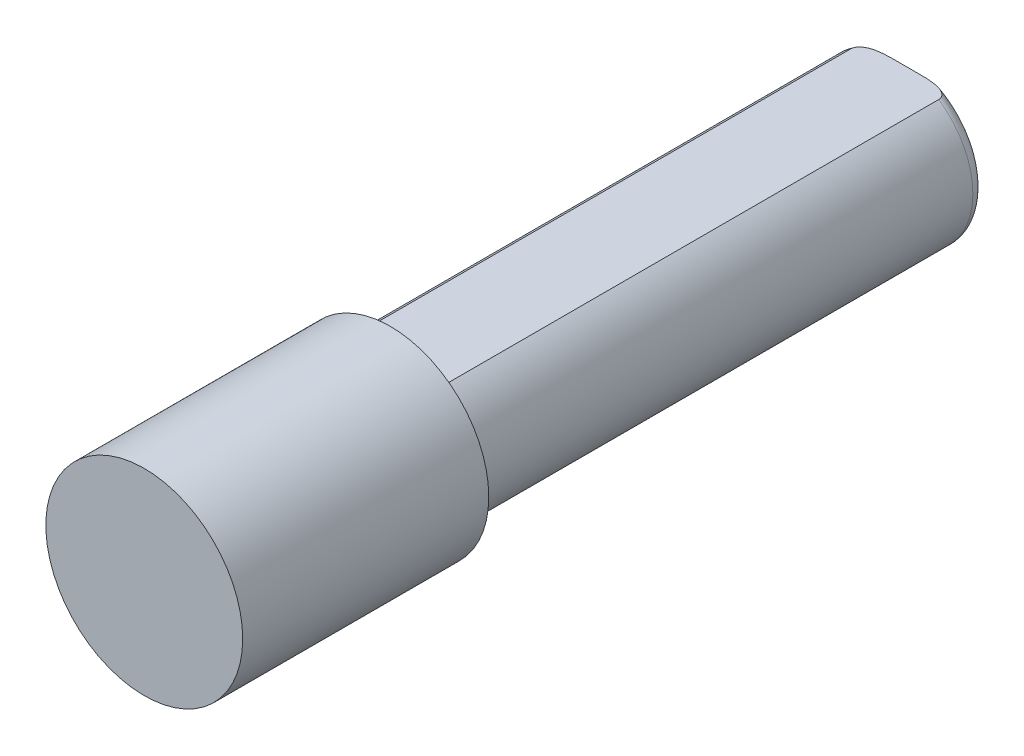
ISO-10303-21;
HEADER;
FILE_DESCRIPTION(('STEP AP214'),'2;1');
FILE_NAME('part.step','',(''),(''),'','','');
FILE_SCHEMA(('AUTOMOTIVE_DESIGN { 1 0 10303 214 1 1 1 1 }'));
ENDSEC;
DATA;
#1=APPLICATION_CONTEXT('core data for automotive mechanical design processes');
#2=APPLICATION_PROTOCOL_DEFINITION('international standard','automotive_design',2000,#1);
#3=PRODUCT_CONTEXT('',#1,'mechanical');
#4=PRODUCT('Part','Part','',(#3));
#5=PRODUCT_RELATED_PRODUCT_CATEGORY('part','',(#4));
#6=PRODUCT_DEFINITION_FORMATION('','',#4);
#7=PRODUCT_DEFINITION_CONTEXT('part definition',#1,'design');
#8=PRODUCT_DEFINITION('design','',#6,#7);
#9=PRODUCT_DEFINITION_SHAPE('','',#8);
#10=(LENGTH_UNIT() NAMED_UNIT(*) SI_UNIT(.MILLI.,.METRE.));
#11=(NAMED_UNIT(*) PLANE_ANGLE_UNIT() SI_UNIT($,.RADIAN.));
#12=(NAMED_UNIT(*) SI_UNIT($,.STERADIAN.) SOLID_ANGLE_UNIT());
#13=UNCERTAINTY_MEASURE_WITH_UNIT(LENGTH_MEASURE(1.E-05),#10,'distance_accuracy_value','');
#14=(GEOMETRIC_REPRESENTATION_CONTEXT(3) GLOBAL_UNCERTAINTY_ASSIGNED_CONTEXT((#13)) GLOBAL_UNIT_ASSIGNED_CONTEXT((#10,
#11,#12)) REPRESENTATION_CONTEXT('',''));
#15=CARTESIAN_POINT('',(0.,0.,0.));
#16=DIRECTION('',(0.,0.,1.));
#17=DIRECTION('',(1.,0.,0.));
#18=AXIS2_PLACEMENT_3D('',#15,#16,#17);
#19=CARTESIAN_POINT('',(0.,0.,21.));
#20=DIRECTION('',(0.,0.,-1.));
#21=DIRECTION('',(-1.,0.,0.));
#22=AXIS2_PLACEMENT_3D('',#19,#20,#21);
#23=CYLINDRICAL_SURFACE('',#22,3.175);
#24=DIRECTION('',(0.,0.,-1.));
#25=VECTOR('',#24,1.);
#26=CARTESIAN_POINT('',(-1.78605710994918,2.625,21.));
#27=LINE('',#26,#25);
#28=CARTESIAN_POINT('',(-1.78605710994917,2.625,21.));
#29=VERTEX_POINT('',#28);
#30=CARTESIAN_POINT('',(-1.78605710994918,2.625,0.500000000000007));
#31=VERTEX_POINT('',#30);
#32=EDGE_CURVE('E69',#29,#31,#27,.T.);
#33=ORIENTED_EDGE('',*,*,#32,.T.);
#34=CARTESIAN_POINT('',(0.,0.,0.5));
#35=DIRECTION('',(0.,0.,1.));
#36=DIRECTION('',(1.,0.,0.));
#37=AXIS2_PLACEMENT_3D('',#34,#35,#36);
#38=CIRCLE('',#37,3.175);
#39=CARTESIAN_POINT('',(1.78605710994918,2.625,0.500000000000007));
#40=VERTEX_POINT('',#39);
#41=EDGE_CURVE('E79',#31,#40,#38,.T.);
#42=ORIENTED_EDGE('',*,*,#41,.T.);
#43=DIRECTION('',(0.,0.,-1.));
#44=VECTOR('',#43,1.);
#45=CARTESIAN_POINT('',(1.78605710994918,2.625,21.));
#46=LINE('',#45,#44);
#47=CARTESIAN_POINT('',(1.78605710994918,2.625,21.));
#48=VERTEX_POINT('',#47);
#49=EDGE_CURVE('E67',#48,#40,#46,.T.);
#50=ORIENTED_EDGE('',*,*,#49,.F.);
#51=CARTESIAN_POINT('',(0.,0.,21.));
#52=DIRECTION('',(0.,0.,1.));
#53=DIRECTION('',(1.,0.,0.));
#54=AXIS2_PLACEMENT_3D('',#51,#52,#53);
#55=CIRCLE('',#54,3.175);
#56=EDGE_CURVE('E77',#29,#48,#55,.T.);
#57=ORIENTED_EDGE('',*,*,#56,.F.);
#58=EDGE_LOOP('',(#33,#42,#50,#57));
#59=FACE_BOUND('',#58,.T.);
#60=ADVANCED_FACE('F33',(#59),#23,.T.);
#61=CARTESIAN_POINT('',(0.,0.,0.));
#62=DIRECTION('',(0.,0.,1.));
#63=DIRECTION('',(1.,0.,0.));
#64=AXIS2_PLACEMENT_3D('',#61,#62,#63);
#65=PLANE('',#64);
#66=DIRECTION('',(-1.,0.,0.));
#67=VECTOR('',#66,1.);
#68=CARTESIAN_POINT('',(1.78605710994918,2.625,0.));
#69=LINE('',#68,#67);
#70=CARTESIAN_POINT('',(0.514781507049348,2.625,0.));
#71=VERTEX_POINT('',#70);
#72=CARTESIAN_POINT('',(-0.514781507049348,2.625,0.));
#73=VERTEX_POINT('',#72);
#74=EDGE_CURVE('E73',#71,#73,#69,.T.);
#75=ORIENTED_EDGE('',*,*,#74,.F.);
#76=CARTESIAN_POINT('',(0.,0.,0.));
#77=DIRECTION('',(0.,0.,1.));
#78=DIRECTION('',(1.,0.,0.));
#79=AXIS2_PLACEMENT_3D('',#76,#77,#78);
#80=CIRCLE('',#79,2.675);
#81=EDGE_CURVE('E11',#71,#73,#80,.F.);
#82=ORIENTED_EDGE('',*,*,#81,.T.);
#83=EDGE_LOOP('',(#75,#82));
#84=FACE_BOUND('',#83,.T.);
#85=ADVANCED_FACE('F109',(#84),#65,.F.);
#86=CARTESIAN_POINT('',(0.,0.,21.));
#87=DIRECTION('',(0.,0.,1.));
#88=DIRECTION('',(1.,0.,0.));
#89=AXIS2_PLACEMENT_3D('',#86,#87,#88);
#90=PLANE('',#89);
#91=CARTESIAN_POINT('',(0.,0.,21.));
#92=DIRECTION('',(0.,0.,1.));
#93=DIRECTION('',(1.,0.,0.));
#94=AXIS2_PLACEMENT_3D('',#91,#92,#93);
#95=CIRCLE('',#94,4.);
#96=CARTESIAN_POINT('',(4.,0.,21.));
#97=VERTEX_POINT('',#96);
#98=EDGE_CURVE('E87',#97,#97,#95,.T.);
#99=ORIENTED_EDGE('',*,*,#98,.F.);
#100=EDGE_LOOP('',(#99));
#101=FACE_BOUND('',#100,.T.);
#102=ORIENTED_EDGE('',*,*,#56,.T.);
#103=DIRECTION('',(-1.,0.,0.));
#104=VECTOR('',#103,1.);
#105=CARTESIAN_POINT('',(1.78605710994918,2.625,21.));
#106=LINE('',#105,#104);
#107=EDGE_CURVE('E64',#48,#29,#106,.T.);
#108=ORIENTED_EDGE('',*,*,#107,.T.);
#109=EDGE_LOOP('',(#102,#108));
#110=FACE_BOUND('',#109,.T.);
#111=ADVANCED_FACE('F81',(#101,#110),#90,.F.);
#112=CARTESIAN_POINT('',(0.,0.,31.));
#113=DIRECTION('',(0.,0.,-1.));
#114=DIRECTION('',(-1.,0.,0.));
#115=AXIS2_PLACEMENT_3D('',#112,#113,#114);
#116=CYLINDRICAL_SURFACE('',#115,4.);
#117=CARTESIAN_POINT('',(0.,0.,31.));
#118=DIRECTION('',(0.,0.,1.));
#119=DIRECTION('',(1.,0.,0.));
#120=AXIS2_PLACEMENT_3D('',#117,#118,#119);
#121=CIRCLE('',#120,4.);
#122=CARTESIAN_POINT('',(4.,0.,31.));
#123=VERTEX_POINT('',#122);
#124=EDGE_CURVE('E82',#123,#123,#121,.T.);
#125=ORIENTED_EDGE('',*,*,#124,.F.);
#126=EDGE_LOOP('',(#125));
#127=FACE_BOUND('',#126,.T.);
#128=ORIENTED_EDGE('',*,*,#98,.T.);
#129=EDGE_LOOP('',(#128));
#130=FACE_BOUND('',#129,.T.);
#131=ADVANCED_FACE('F105',(#127,#130),#116,.T.);
#132=CARTESIAN_POINT('',(0.,0.,31.));
#133=DIRECTION('',(0.,0.,1.));
#134=DIRECTION('',(1.,0.,0.));
#135=AXIS2_PLACEMENT_3D('',#132,#133,#134);
#136=PLANE('',#135);
#137=ORIENTED_EDGE('',*,*,#124,.T.);
#138=EDGE_LOOP('',(#137));
#139=FACE_BOUND('',#138,.T.);
#140=ADVANCED_FACE('F101',(#139),#136,.T.);
#141=CARTESIAN_POINT('',(1.78605710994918,2.625,21.));
#142=DIRECTION('',(0.,-1.,0.));
#143=DIRECTION('',(0.,0.,-1.));
#144=AXIS2_PLACEMENT_3D('',#141,#142,#143);
#145=PLANE('',#144);
#146=ORIENTED_EDGE('',*,*,#49,.T.);
#147=CARTESIAN_POINT('',(1.78605710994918,2.625,0.499999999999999));
#148=CARTESIAN_POINT('',(1.78611836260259,2.625,0.48051502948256));
#149=CARTESIAN_POINT('',(1.78403706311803,2.625,0.461106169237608));
#150=CARTESIAN_POINT('',(1.77614566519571,2.625,0.42329182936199));
#151=CARTESIAN_POINT('',(1.77038040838,2.625,0.404877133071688));
#152=CARTESIAN_POINT('',(1.75568721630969,2.625,0.369486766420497));
#153=CARTESIAN_POINT('',(1.74677356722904,2.625,0.352505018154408));
#154=CARTESIAN_POINT('',(1.72641804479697,2.625,0.320088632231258));
#155=CARTESIAN_POINT('',(1.71496821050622,2.625,0.304659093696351));
#156=CARTESIAN_POINT('',(1.6838317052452,2.625,0.268033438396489));
#157=CARTESIAN_POINT('',(1.66291485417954,2.625,0.247887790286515));
#158=CARTESIAN_POINT('',(1.61825721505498,2.625,0.211090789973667));
#159=CARTESIAN_POINT('',(1.59451232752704,2.625,0.194444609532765));
#160=CARTESIAN_POINT('',(1.52776741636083,2.625,0.153457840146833));
#161=CARTESIAN_POINT('',(1.48301267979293,2.625,0.131986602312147));
#162=CARTESIAN_POINT('',(1.413898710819,2.625,0.104695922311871));
#163=CARTESIAN_POINT('',(1.39041958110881,2.625,0.0963921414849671));
#164=CARTESIAN_POINT('',(1.34299986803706,2.625,0.0812423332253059));
#165=CARTESIAN_POINT('',(1.31905952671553,2.625,0.0743955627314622));
#166=CARTESIAN_POINT('',(1.23008070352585,2.625,0.0514093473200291));
#167=CARTESIAN_POINT('',(1.16404779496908,2.625,0.0391500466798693));
#168=CARTESIAN_POINT('',(1.03103589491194,2.625,0.0205768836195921));
#169=CARTESIAN_POINT('',(0.964054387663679,2.625,0.0142841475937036));
#170=CARTESIAN_POINT('',(0.833124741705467,2.625,0.00573297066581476));
#171=CARTESIAN_POINT('',(0.769187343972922,2.625,0.00329337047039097));
#172=CARTESIAN_POINT('',(0.673494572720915,2.625,0.00114815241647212));
#173=CARTESIAN_POINT('',(0.641749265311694,2.625,0.000684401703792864));
#174=CARTESIAN_POINT('',(0.578263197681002,2.625,0.000111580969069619));
#175=CARTESIAN_POINT('',(0.546522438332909,2.625,2.42149440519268E-06));
#176=CARTESIAN_POINT('',(0.514781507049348,2.625,0.));
#177=B_SPLINE_CURVE_WITH_KNOTS('',3,(#147,#148,#149,#150,#151,#152,#153,#154,#155,#156,#157,
#158,#159,#160,#161,#162,#163,#164,#165,#166,#167,#168,#169,#170,#171,#172,#173,#174,#175,#176),
.UNSPECIFIED.,.F.,.F.,(4,2,2,2,2,2,2,2,2,2,2,2,2,2,4),(0.,0.0582234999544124,0.115751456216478,
0.173021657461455,0.230474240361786,0.317101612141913,0.403856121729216,0.551884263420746,
0.626577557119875,0.701232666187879,0.902214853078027,1.10390604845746,1.29579765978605,
1.39104324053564,1.48626479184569),.UNSPECIFIED.);
#178=EDGE_CURVE('E42',#40,#71,#177,.T.);
#179=ORIENTED_EDGE('',*,*,#178,.T.);
#180=ORIENTED_EDGE('',*,*,#74,.T.);
#181=CARTESIAN_POINT('',(-0.514781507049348,2.625,0.));
#182=CARTESIAN_POINT('',(-0.545138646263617,2.625,1.99675866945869E-06));
#183=CARTESIAN_POINT('',(-0.575495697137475,2.625,0.000102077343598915));
#184=CARTESIAN_POINT('',(-0.636213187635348,2.625,0.000620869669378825));
#185=CARTESIAN_POINT('',(-0.666573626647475,2.625,0.00103964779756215));
#186=CARTESIAN_POINT('',(-0.757972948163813,2.625,0.00296465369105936));
#187=CARTESIAN_POINT('',(-0.819003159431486,2.625,0.00514219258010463));
#188=CARTESIAN_POINT('',(-0.941825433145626,2.625,0.0125778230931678));
#189=CARTESIAN_POINT('',(-1.00361494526,2.625,0.0178823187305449));
#190=CARTESIAN_POINT('',(-1.12651560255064,2.625,0.0332527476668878));
#191=CARTESIAN_POINT('',(-1.18762806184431,2.625,0.0433066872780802));
#192=CARTESIAN_POINT('',(-1.2824385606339,2.625,0.0645844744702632));
#193=CARTESIAN_POINT('',(-1.31665689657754,2.625,0.0734587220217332));
#194=CARTESIAN_POINT('',(-1.38423460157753,2.625,0.094030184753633));
#195=CARTESIAN_POINT('',(-1.41759448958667,2.625,0.105725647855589));
#196=CARTESIAN_POINT('',(-1.48318231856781,2.625,0.132705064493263));
#197=CARTESIAN_POINT('',(-1.51539860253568,2.625,0.148017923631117));
#198=CARTESIAN_POINT('',(-1.57740901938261,2.625,0.182992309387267));
#199=CARTESIAN_POINT('',(-1.60720754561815,2.625,0.202645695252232));
#200=CARTESIAN_POINT('',(-1.65201841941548,2.625,0.238603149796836));
#201=CARTESIAN_POINT('',(-1.66831627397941,2.625,0.253297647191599));
#202=CARTESIAN_POINT('',(-1.69872512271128,2.625,0.284824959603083));
#203=CARTESIAN_POINT('',(-1.71283757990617,2.625,0.301656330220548));
#204=CARTESIAN_POINT('',(-1.73617877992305,2.625,0.334788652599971));
#205=CARTESIAN_POINT('',(-1.74582188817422,2.625,0.350794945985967));
#206=CARTESIAN_POINT('',(-1.76232487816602,2.625,0.384164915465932));
#207=CARTESIAN_POINT('',(-1.76919194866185,2.625,0.401524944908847));
#208=CARTESIAN_POINT('',(-1.77820439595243,2.625,0.432417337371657));
#209=CARTESIAN_POINT('',(-1.78112252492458,2.625,0.445725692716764));
#210=CARTESIAN_POINT('',(-1.78506131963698,2.625,0.472682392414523));
#211=CARTESIAN_POINT('',(-1.78607295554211,2.625,0.486332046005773));
#212=CARTESIAN_POINT('',(-1.78605710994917,2.625,0.5));
#213=B_SPLINE_CURVE_WITH_KNOTS('',3,(#181,#182,#183,#184,#185,#186,#187,#188,#189,#190,#191,
#192,#193,#194,#195,#196,#197,#198,#199,#200,#201,#202,#203,#204,#205,#206,#207,#208,#209,#210,
#211,#212),.UNSPECIFIED.,.F.,.F.,(4,2,2,2,2,2,2,2,2,2,2,2,2,2,2,4),(0.,0.0910704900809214,
0.182159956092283,0.3653187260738,0.551266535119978,0.736747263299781,0.842706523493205,
0.948600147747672,1.05537040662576,1.16194209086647,1.22761113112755,1.29323601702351,
1.34908253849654,1.40478350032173,1.44552659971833,1.48646219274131),.UNSPECIFIED.);
#214=EDGE_CURVE('E84',#73,#31,#213,.T.);
#215=ORIENTED_EDGE('',*,*,#214,.T.);
#216=ORIENTED_EDGE('',*,*,#32,.F.);
#217=ORIENTED_EDGE('',*,*,#107,.F.);
#218=EDGE_LOOP('',(#146,#179,#180,#215,#216,#217));
#219=FACE_BOUND('',#218,.T.);
#220=ADVANCED_FACE('F66',(#219),#145,.F.);
#221=CARTESIAN_POINT('',(0.,0.,0.5));
#222=DIRECTION('',(0.,0.,1.));
#223=DIRECTION('',(1.,0.,0.));
#224=AXIS2_PLACEMENT_3D('',#221,#222,#223);
#225=TOROIDAL_SURFACE('',#224,2.675,0.5);
#226=ORIENTED_EDGE('',*,*,#214,.F.);
#227=ORIENTED_EDGE('',*,*,#81,.F.);
#228=ORIENTED_EDGE('',*,*,#178,.F.);
#229=ORIENTED_EDGE('',*,*,#41,.F.);
#230=EDGE_LOOP('',(#226,#227,#228,#229));
#231=FACE_BOUND('',#230,.T.);
#232=ADVANCED_FACE('F35',(#231),#225,.T.);
#233=CLOSED_SHELL('',(#60,#85,#111,#131,#140,#220,#232));
#234=MANIFOLD_SOLID_BREP('B2',#233);
#235=ADVANCED_BREP_SHAPE_REPRESENTATION('',(#18,#234),#14);
#236=SHAPE_DEFINITION_REPRESENTATION(#9,#235);
ENDSEC;
END-ISO-10303-21;
